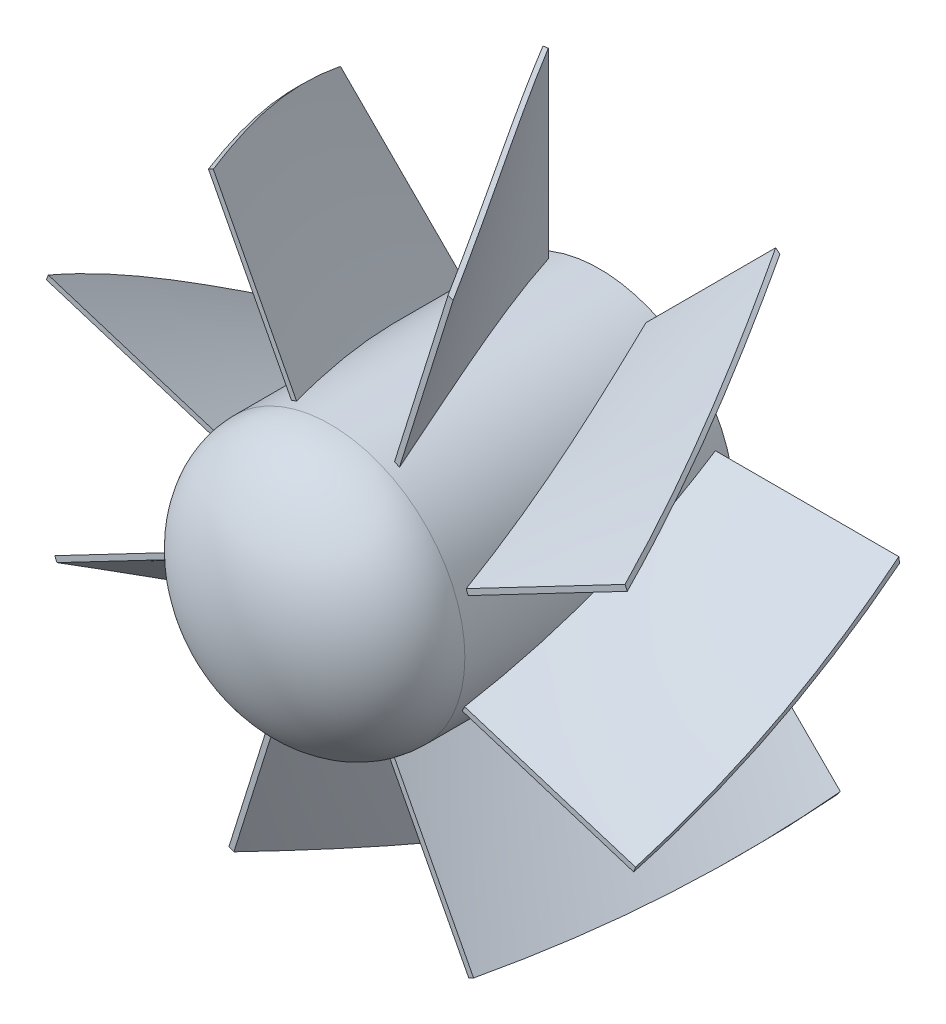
from build123d import *

# Parameters (mm, degrees)
SKETCH1_R           = 31.75
BOSS_EXTRUDE1_DEPTH = 63.5
CIRPATTERN1_COUNT   = 8
DOME1_FACE_RADIUS   = 31.75
DOME1_HEIGHT        = 22.86
SKETCH5_R           = 99.598975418
SKETCH5_R_2         = 73.910562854
CUT_EXTRUDE1_DEPTH  = 106.68
SKETCH6_R           = 15.875
CUT_EXTRUDE2_DEPTH  = 38.1


with BuildPart() as part:
    # Sketch1 → Boss-Extrude1 (new body)
    with BuildSketch(Plane.XY):
        Circle(SKETCH1_R)
    extrude(amount=BOSS_EXTRUDE1_DEPTH)

    # Sketch2 → Loft1 section 0
    with BuildSketch(Plane.XY.offset(2.54)):
        with BuildLine():
            Line((-26.024008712, -10.793541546), (-76.824008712, -10.793541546))
            Line((-76.824008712, -10.793541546), (-76.824008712, -9.523541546))
            Line((-76.824008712, -9.523541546), (-26.024008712, -9.523541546))
            Line((-26.024008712, -9.523541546), (-26.024008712, -10.793541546))
        make_face()
    # Sketch4 → Loft1 section 1
    with BuildSketch(Plane.XY.offset(60.96)):
        with BuildLine():
            Line((-26.0189838, 12.977398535), (-76.8189838, 28.882694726))
            Line((-76.8189838, 28.882694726), (-77.198451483, 27.670711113))
            Line((-77.198451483, 27.670711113), (-26.398451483, 11.765414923))
            Line((-26.398451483, 11.765414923), (-26.0189838, 12.977398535))
        make_face()
    loft1 = loft()

    # CirPattern1: Loft1 ×8 about axis
    cirpattern1_axis = Axis((0, 0, 63.5), (0, 0, 1))
    for i in range(1, CIRPATTERN1_COUNT):
        add(loft1.rotate(cirpattern1_axis, i * 360 / CIRPATTERN1_COUNT))

    # Dome1: an elliptical dome of height H over a round flat face of radius A is half a spheroid: the quarter ellipse of half axes A and H revolved about the face's axis
    with BuildSketch(Plane((0, 0, 63.5), x_dir=(0, 1, 0), z_dir=(1, 0, 0)), mode=Mode.PRIVATE) as dome1_quarter:
        Ellipse(DOME1_FACE_RADIUS, DOME1_HEIGHT)
        Rectangle(DOME1_FACE_RADIUS, DOME1_HEIGHT, align=(Align.MIN, Align.MIN), mode=Mode.INTERSECT)
    revolve(dome1_quarter.sketch, axis=Axis((0, 0, 63.5), (0, 0, 1)))

    # Sketch5 → Cut-Extrude1 (cut)
    with BuildSketch(Plane(origin=(0, 0, 0), x_dir=(-1, 0, 0), z_dir=(0, 0, -1))):
        Circle(SKETCH5_R)
        Circle(SKETCH5_R_2, mode=Mode.SUBTRACT)
    extrude(amount=-CUT_EXTRUDE1_DEPTH, mode=Mode.SUBTRACT)

    # Sketch6 → Cut-Extrude2 (cut)
    with BuildSketch(Plane(origin=(0, 0, 0), x_dir=(-1, 0, 0), z_dir=(0, 0, -1))):
        Circle(SKETCH6_R)
    extrude(amount=-CUT_EXTRUDE2_DEPTH, mode=Mode.SUBTRACT)


solid = part.part
